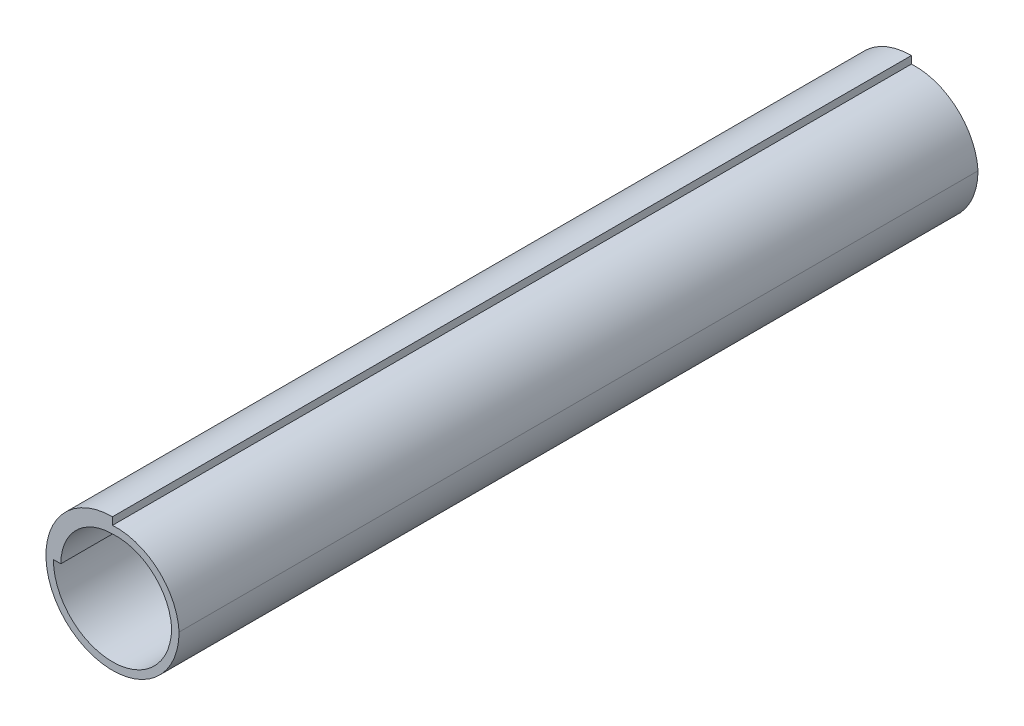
ISO-10303-21;
HEADER;
FILE_DESCRIPTION(('STEP AP214'),'2;1');
FILE_NAME('part.step','',(''),(''),'','','');
FILE_SCHEMA(('AUTOMOTIVE_DESIGN { 1 0 10303 214 1 1 1 1 }'));
ENDSEC;
DATA;
#1=APPLICATION_CONTEXT('core data for automotive mechanical design processes');
#2=APPLICATION_PROTOCOL_DEFINITION('international standard','automotive_design',2000,#1);
#3=PRODUCT_CONTEXT('',#1,'mechanical');
#4=PRODUCT('Part','Part','',(#3));
#5=PRODUCT_RELATED_PRODUCT_CATEGORY('part','',(#4));
#6=PRODUCT_DEFINITION_FORMATION('','',#4);
#7=PRODUCT_DEFINITION_CONTEXT('part definition',#1,'design');
#8=PRODUCT_DEFINITION('design','',#6,#7);
#9=PRODUCT_DEFINITION_SHAPE('','',#8);
#10=(LENGTH_UNIT() NAMED_UNIT(*) SI_UNIT(.MILLI.,.METRE.));
#11=(NAMED_UNIT(*) PLANE_ANGLE_UNIT() SI_UNIT($,.RADIAN.));
#12=(NAMED_UNIT(*) SI_UNIT($,.STERADIAN.) SOLID_ANGLE_UNIT());
#13=UNCERTAINTY_MEASURE_WITH_UNIT(LENGTH_MEASURE(1.E-05),#10,'distance_accuracy_value','');
#14=(GEOMETRIC_REPRESENTATION_CONTEXT(3) GLOBAL_UNCERTAINTY_ASSIGNED_CONTEXT((#13)) GLOBAL_UNIT_ASSIGNED_CONTEXT((#10,
#11,#12)) REPRESENTATION_CONTEXT('',''));
#15=CARTESIAN_POINT('',(0.,0.,0.));
#16=DIRECTION('',(0.,0.,1.));
#17=DIRECTION('',(1.,0.,0.));
#18=AXIS2_PLACEMENT_3D('',#15,#16,#17);
#19=CARTESIAN_POINT('',(0.140000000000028,-0.139999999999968,15.));
#20=DIRECTION('',(0.,0.,1.));
#21=DIRECTION('',(1.,0.,0.));
#22=AXIS2_PLACEMENT_3D('',#19,#20,#21);
#23=PLANE('',#22);
#24=CARTESIAN_POINT('',(0.140000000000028,-0.139999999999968,15.));
#25=DIRECTION('',(0.,0.,1.));
#26=DIRECTION('',(1.,0.,0.));
#27=AXIS2_PLACEMENT_3D('',#24,#25,#26);
#28=CIRCLE('',#27,2.36414889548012);
#29=CARTESIAN_POINT('',(2.5,0.,15.));
#30=VERTEX_POINT('',#29);
#31=CARTESIAN_POINT('',(0.,2.22,15.));
#32=VERTEX_POINT('',#31);
#33=EDGE_CURVE('E128',#30,#32,#28,.T.);
#34=ORIENTED_EDGE('',*,*,#33,.T.);
#35=DIRECTION('',(0.,1.,0.));
#36=VECTOR('',#35,1.);
#37=CARTESIAN_POINT('',(0.,2.22,15.));
#38=LINE('',#37,#36);
#39=CARTESIAN_POINT('',(0.,2.5,15.));
#40=VERTEX_POINT('',#39);
#41=EDGE_CURVE('E131',#32,#40,#38,.T.);
#42=ORIENTED_EDGE('',*,*,#41,.T.);
#43=CARTESIAN_POINT('',(0.,0.,15.));
#44=DIRECTION('',(0.,0.,1.));
#45=DIRECTION('',(1.,0.,0.));
#46=AXIS2_PLACEMENT_3D('',#43,#44,#45);
#47=CIRCLE('',#46,2.5);
#48=EDGE_CURVE('E134',#40,#30,#47,.T.);
#49=ORIENTED_EDGE('',*,*,#48,.T.);
#50=EDGE_LOOP('',(#34,#42,#49));
#51=FACE_BOUND('',#50,.T.);
#52=CARTESIAN_POINT('',(0.140000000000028,-0.139999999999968,15.));
#53=DIRECTION('',(0.,0.,1.));
#54=DIRECTION('',(1.,0.,0.));
#55=AXIS2_PLACEMENT_3D('',#52,#53,#54);
#56=CIRCLE('',#55,2.08470621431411);
#57=CARTESIAN_POINT('',(2.22,0.,15.));
#58=VERTEX_POINT('',#57);
#59=CARTESIAN_POINT('',(0.,1.94,15.));
#60=VERTEX_POINT('',#59);
#61=EDGE_CURVE('E100',#58,#60,#56,.T.);
#62=ORIENTED_EDGE('',*,*,#61,.F.);
#63=CARTESIAN_POINT('',(0.,0.,15.));
#64=DIRECTION('',(0.,0.,1.));
#65=DIRECTION('',(1.,0.,0.));
#66=AXIS2_PLACEMENT_3D('',#63,#64,#65);
#67=CIRCLE('',#66,2.22);
#68=CARTESIAN_POINT('',(-2.22,0.,15.));
#69=VERTEX_POINT('',#68);
#70=EDGE_CURVE('E92',#69,#58,#67,.T.);
#71=ORIENTED_EDGE('',*,*,#70,.F.);
#72=DIRECTION('',(-1.,0.,0.));
#73=VECTOR('',#72,1.);
#74=CARTESIAN_POINT('',(-2.22,0.,15.));
#75=LINE('',#74,#73);
#76=CARTESIAN_POINT('',(-1.94,0.,15.));
#77=VERTEX_POINT('',#76);
#78=EDGE_CURVE('E114',#77,#69,#75,.T.);
#79=ORIENTED_EDGE('',*,*,#78,.F.);
#80=CARTESIAN_POINT('',(0.,0.,15.));
#81=DIRECTION('',(0.,0.,1.));
#82=DIRECTION('',(1.,0.,0.));
#83=AXIS2_PLACEMENT_3D('',#80,#81,#82);
#84=CIRCLE('',#83,1.94);
#85=EDGE_CURVE('E112',#60,#77,#84,.T.);
#86=ORIENTED_EDGE('',*,*,#85,.F.);
#87=EDGE_LOOP('',(#62,#71,#79,#86));
#88=FACE_BOUND('',#87,.T.);
#89=ADVANCED_FACE('F33',(#51,#88),#23,.T.);
#90=CARTESIAN_POINT('',(0.140000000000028,-0.139999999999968,-15.));
#91=DIRECTION('',(0.,0.,1.));
#92=DIRECTION('',(1.,0.,0.));
#93=AXIS2_PLACEMENT_3D('',#90,#91,#92);
#94=PLANE('',#93);
#95=CARTESIAN_POINT('',(0.140000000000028,-0.139999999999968,-15.));
#96=DIRECTION('',(0.,0.,1.));
#97=DIRECTION('',(1.,0.,0.));
#98=AXIS2_PLACEMENT_3D('',#95,#96,#97);
#99=CIRCLE('',#98,2.36414889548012);
#100=CARTESIAN_POINT('',(2.5,0.,-15.));
#101=VERTEX_POINT('',#100);
#102=CARTESIAN_POINT('',(0.,2.22,-15.));
#103=VERTEX_POINT('',#102);
#104=EDGE_CURVE('E108',#101,#103,#99,.T.);
#105=ORIENTED_EDGE('',*,*,#104,.F.);
#106=CARTESIAN_POINT('',(0.,0.,-15.));
#107=DIRECTION('',(0.,0.,1.));
#108=DIRECTION('',(1.,0.,0.));
#109=AXIS2_PLACEMENT_3D('',#106,#107,#108);
#110=CIRCLE('',#109,2.5);
#111=CARTESIAN_POINT('',(0.,2.5,-15.));
#112=VERTEX_POINT('',#111);
#113=EDGE_CURVE('E132',#112,#101,#110,.T.);
#114=ORIENTED_EDGE('',*,*,#113,.F.);
#115=DIRECTION('',(0.,1.,0.));
#116=VECTOR('',#115,1.);
#117=CARTESIAN_POINT('',(0.,2.22,-15.));
#118=LINE('',#117,#116);
#119=EDGE_CURVE('E139',#103,#112,#118,.T.);
#120=ORIENTED_EDGE('',*,*,#119,.F.);
#121=EDGE_LOOP('',(#105,#114,#120));
#122=FACE_BOUND('',#121,.T.);
#123=CARTESIAN_POINT('',(0.,0.,-15.));
#124=DIRECTION('',(0.,0.,1.));
#125=DIRECTION('',(1.,0.,0.));
#126=AXIS2_PLACEMENT_3D('',#123,#124,#125);
#127=CIRCLE('',#126,2.22);
#128=CARTESIAN_POINT('',(-2.22,0.,-15.));
#129=VERTEX_POINT('',#128);
#130=CARTESIAN_POINT('',(2.22,0.,-15.));
#131=VERTEX_POINT('',#130);
#132=EDGE_CURVE('E56',#129,#131,#127,.T.);
#133=ORIENTED_EDGE('',*,*,#132,.T.);
#134=CARTESIAN_POINT('',(0.140000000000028,-0.139999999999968,-15.));
#135=DIRECTION('',(0.,0.,1.));
#136=DIRECTION('',(1.,0.,0.));
#137=AXIS2_PLACEMENT_3D('',#134,#135,#136);
#138=CIRCLE('',#137,2.08470621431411);
#139=CARTESIAN_POINT('',(0.,1.94,-15.));
#140=VERTEX_POINT('',#139);
#141=EDGE_CURVE('E107',#131,#140,#138,.T.);
#142=ORIENTED_EDGE('',*,*,#141,.T.);
#143=CARTESIAN_POINT('',(0.,0.,-15.));
#144=DIRECTION('',(0.,0.,1.));
#145=DIRECTION('',(1.,0.,0.));
#146=AXIS2_PLACEMENT_3D('',#143,#144,#145);
#147=CIRCLE('',#146,1.94);
#148=CARTESIAN_POINT('',(-1.94,0.,-15.));
#149=VERTEX_POINT('',#148);
#150=EDGE_CURVE('E120',#140,#149,#147,.T.);
#151=ORIENTED_EDGE('',*,*,#150,.T.);
#152=DIRECTION('',(-1.,0.,0.));
#153=VECTOR('',#152,1.);
#154=CARTESIAN_POINT('',(-2.22,0.,-15.));
#155=LINE('',#154,#153);
#156=EDGE_CURVE('E101',#149,#129,#155,.T.);
#157=ORIENTED_EDGE('',*,*,#156,.T.);
#158=EDGE_LOOP('',(#133,#142,#151,#157));
#159=FACE_BOUND('',#158,.T.);
#160=ADVANCED_FACE('F153',(#122,#159),#94,.F.);
#161=CARTESIAN_POINT('',(0.140000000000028,-0.139999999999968,15.));
#162=DIRECTION('',(0.,0.,-1.));
#163=DIRECTION('',(-1.,0.,0.));
#164=AXIS2_PLACEMENT_3D('',#161,#162,#163);
#165=CYLINDRICAL_SURFACE('',#164,2.36414889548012);
#166=ORIENTED_EDGE('',*,*,#104,.T.);
#167=DIRECTION('',(0.,0.,-1.));
#168=VECTOR('',#167,1.);
#169=CARTESIAN_POINT('',(0.,2.22,15.));
#170=LINE('',#169,#168);
#171=EDGE_CURVE('E11',#32,#103,#170,.T.);
#172=ORIENTED_EDGE('',*,*,#171,.F.);
#173=ORIENTED_EDGE('',*,*,#33,.F.);
#174=DIRECTION('',(0.,0.,-1.));
#175=VECTOR('',#174,1.);
#176=CARTESIAN_POINT('',(2.5,0.,15.));
#177=LINE('',#176,#175);
#178=EDGE_CURVE('E136',#30,#101,#177,.T.);
#179=ORIENTED_EDGE('',*,*,#178,.T.);
#180=EDGE_LOOP('',(#166,#172,#173,#179));
#181=FACE_BOUND('',#180,.T.);
#182=ADVANCED_FACE('F35',(#181),#165,.T.);
#183=CARTESIAN_POINT('',(0.,2.22,15.));
#184=DIRECTION('',(-1.,0.,0.));
#185=DIRECTION('',(0.,0.,1.));
#186=AXIS2_PLACEMENT_3D('',#183,#184,#185);
#187=PLANE('',#186);
#188=ORIENTED_EDGE('',*,*,#119,.T.);
#189=DIRECTION('',(0.,0.,-1.));
#190=VECTOR('',#189,1.);
#191=CARTESIAN_POINT('',(0.,2.5,15.));
#192=LINE('',#191,#190);
#193=EDGE_CURVE('E41',#40,#112,#192,.T.);
#194=ORIENTED_EDGE('',*,*,#193,.F.);
#195=ORIENTED_EDGE('',*,*,#41,.F.);
#196=ORIENTED_EDGE('',*,*,#171,.T.);
#197=EDGE_LOOP('',(#188,#194,#195,#196));
#198=FACE_BOUND('',#197,.T.);
#199=ADVANCED_FACE('F159',(#198),#187,.F.);
#200=CARTESIAN_POINT('',(0.,0.,15.));
#201=DIRECTION('',(0.,0.,-1.));
#202=DIRECTION('',(-1.,0.,0.));
#203=AXIS2_PLACEMENT_3D('',#200,#201,#202);
#204=CYLINDRICAL_SURFACE('',#203,2.5);
#205=ORIENTED_EDGE('',*,*,#113,.T.);
#206=ORIENTED_EDGE('',*,*,#178,.F.);
#207=ORIENTED_EDGE('',*,*,#48,.F.);
#208=ORIENTED_EDGE('',*,*,#193,.T.);
#209=EDGE_LOOP('',(#205,#206,#207,#208));
#210=FACE_BOUND('',#209,.T.);
#211=ADVANCED_FACE('F148',(#210),#204,.T.);
#212=CARTESIAN_POINT('',(0.,0.,15.));
#213=DIRECTION('',(0.,0.,-1.));
#214=DIRECTION('',(-1.,0.,0.));
#215=AXIS2_PLACEMENT_3D('',#212,#213,#214);
#216=CYLINDRICAL_SURFACE('',#215,2.22);
#217=ORIENTED_EDGE('',*,*,#132,.F.);
#218=DIRECTION('',(0.,0.,-1.));
#219=VECTOR('',#218,1.);
#220=CARTESIAN_POINT('',(-2.22,0.,15.));
#221=LINE('',#220,#219);
#222=EDGE_CURVE('E96',#69,#129,#221,.T.);
#223=ORIENTED_EDGE('',*,*,#222,.F.);
#224=ORIENTED_EDGE('',*,*,#70,.T.);
#225=DIRECTION('',(0.,0.,-1.));
#226=VECTOR('',#225,1.);
#227=CARTESIAN_POINT('',(2.22,0.,15.));
#228=LINE('',#227,#226);
#229=EDGE_CURVE('E95',#58,#131,#228,.T.);
#230=ORIENTED_EDGE('',*,*,#229,.T.);
#231=EDGE_LOOP('',(#217,#223,#224,#230));
#232=FACE_BOUND('',#231,.T.);
#233=ADVANCED_FACE('F94',(#232),#216,.F.);
#234=CARTESIAN_POINT('',(0.140000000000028,-0.139999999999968,15.));
#235=DIRECTION('',(0.,0.,-1.));
#236=DIRECTION('',(-1.,0.,0.));
#237=AXIS2_PLACEMENT_3D('',#234,#235,#236);
#238=CYLINDRICAL_SURFACE('',#237,2.08470621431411);
#239=ORIENTED_EDGE('',*,*,#141,.F.);
#240=ORIENTED_EDGE('',*,*,#229,.F.);
#241=ORIENTED_EDGE('',*,*,#61,.T.);
#242=DIRECTION('',(0.,0.,-1.));
#243=VECTOR('',#242,1.);
#244=CARTESIAN_POINT('',(0.,1.94,15.));
#245=LINE('',#244,#243);
#246=EDGE_CURVE('E109',#60,#140,#245,.T.);
#247=ORIENTED_EDGE('',*,*,#246,.T.);
#248=EDGE_LOOP('',(#239,#240,#241,#247));
#249=FACE_BOUND('',#248,.T.);
#250=ADVANCED_FACE('F104',(#249),#238,.F.);
#251=CARTESIAN_POINT('',(0.,0.,15.));
#252=DIRECTION('',(0.,0.,-1.));
#253=DIRECTION('',(-1.,0.,0.));
#254=AXIS2_PLACEMENT_3D('',#251,#252,#253);
#255=CYLINDRICAL_SURFACE('',#254,1.94);
#256=ORIENTED_EDGE('',*,*,#150,.F.);
#257=ORIENTED_EDGE('',*,*,#246,.F.);
#258=ORIENTED_EDGE('',*,*,#85,.T.);
#259=DIRECTION('',(0.,0.,-1.));
#260=VECTOR('',#259,1.);
#261=CARTESIAN_POINT('',(-1.94,0.,15.));
#262=LINE('',#261,#260);
#263=EDGE_CURVE('E48',#77,#149,#262,.T.);
#264=ORIENTED_EDGE('',*,*,#263,.T.);
#265=EDGE_LOOP('',(#256,#257,#258,#264));
#266=FACE_BOUND('',#265,.T.);
#267=ADVANCED_FACE('F177',(#266),#255,.F.);
#268=CARTESIAN_POINT('',(-2.22,0.,15.));
#269=DIRECTION('',(0.,-1.,0.));
#270=DIRECTION('',(0.,0.,-1.));
#271=AXIS2_PLACEMENT_3D('',#268,#269,#270);
#272=PLANE('',#271);
#273=ORIENTED_EDGE('',*,*,#156,.F.);
#274=ORIENTED_EDGE('',*,*,#263,.F.);
#275=ORIENTED_EDGE('',*,*,#78,.T.);
#276=ORIENTED_EDGE('',*,*,#222,.T.);
#277=EDGE_LOOP('',(#273,#274,#275,#276));
#278=FACE_BOUND('',#277,.T.);
#279=ADVANCED_FACE('F180',(#278),#272,.T.);
#280=CLOSED_SHELL('',(#89,#160,#182,#199,#211,#233,#250,#267,#279));
#281=MANIFOLD_SOLID_BREP('B2',#280);
#282=ADVANCED_BREP_SHAPE_REPRESENTATION('',(#18,#281),#14);
#283=SHAPE_DEFINITION_REPRESENTATION(#9,#282);
ENDSEC;
END-ISO-10303-21;
